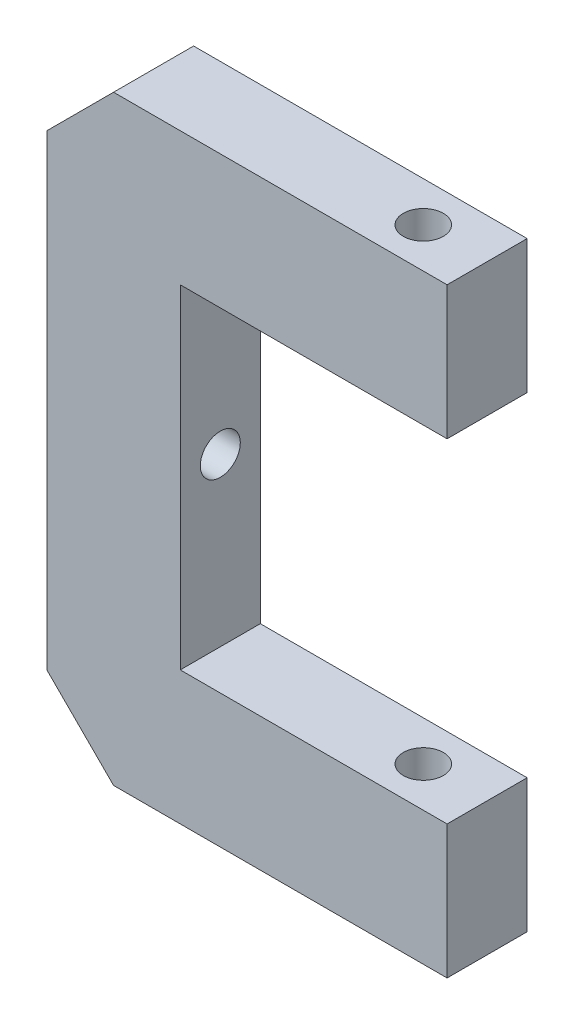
from build123d import *

# Parameters (mm, degrees)
EXTRUDE1_DEPTH = 6
SKETCH2_R      = 1.5
EXTRUDE2_DEPTH = 55.415071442
SKETCH5_R      = 1.5
EXTRUDE3_DEPTH = 55.415071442
CHAMFER1_SIZE  = 5


with BuildPart() as part:
    # Sketch1 → Extrude1 (new body)
    with BuildSketch(Plane.XY):
        Polygon((0, 0), (30, 0), (30, 10), (10, 10), (10, 35), (30, 35), (30, 45), (0, 45), align=None)
    extrude(amount=EXTRUDE1_DEPTH)

    # Sketch2 → Extrude2 (cut, through all)
    with BuildSketch(Plane(origin=(0, 45, 0), x_dir=(1, 0, 0), z_dir=(0, 1, 0))):
        with Locations(Location((25.216978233, -3, 0), (0, 0, 180))):
            Circle(SKETCH2_R)
    extrude(amount=-EXTRUDE2_DEPTH, mode=Mode.SUBTRACT)

    # Sketch5 → Extrude3 (cut, through all)
    with BuildSketch(Plane.ZY):
        with Locations(Location((3, 22.5, 0), (0, 0, 270))):
            Circle(SKETCH5_R)
    extrude(amount=-EXTRUDE3_DEPTH, mode=Mode.SUBTRACT)

    # Chamfer1
    chamfer1_edges = [part.edges().sort_by_distance(p)[0] for p in [
        (0, 45, 3),
        (0, 0, 3),
    ]]
    chamfer(chamfer1_edges, length=CHAMFER1_SIZE)


solid = part.part
